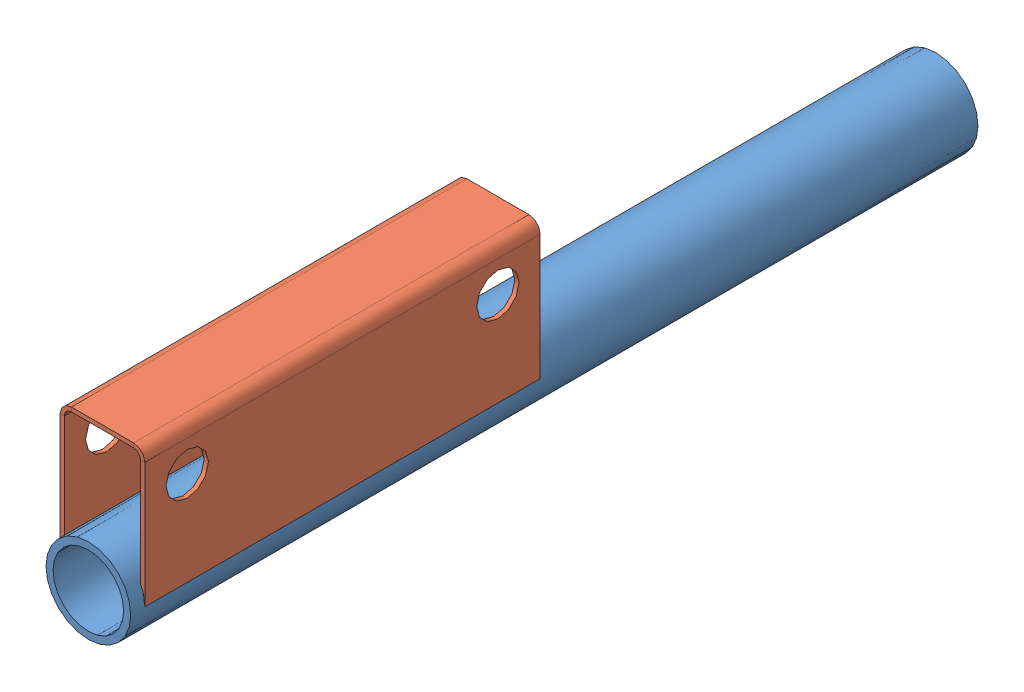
SolidWorks assembly Potence plateau.SLDASM, configuration Défaut (file format 3100). Lengths in mm.
Overall size (60 126.59 600).
2 component instances, 2 part files, 3 mates.
Components (placement in the parent):
- Cylindre plateau-1: Cylindre plateau.SLDPRT [Défaut] at (14.5729 -1.1725 -300) size (60 60 600)
- Support bras-1: Support bras.SLDPRT [Défaut] at (-105.4271 95.4184 10) x (1 0 0) z (0 -1 0) size (60 280 96.59)
Mates (geometry in assembly coordinates):
- Tangent1: tangent: cylinder of Cylindre plateau-1; plane of Support bras-1
- Coïncidente1: coincident: plane of Cylindre plateau-1; plane of Support bras-1
- Distance1: distance = 10 mm aligned: plane of Cylindre plateau-1; plane of Support bras-1
